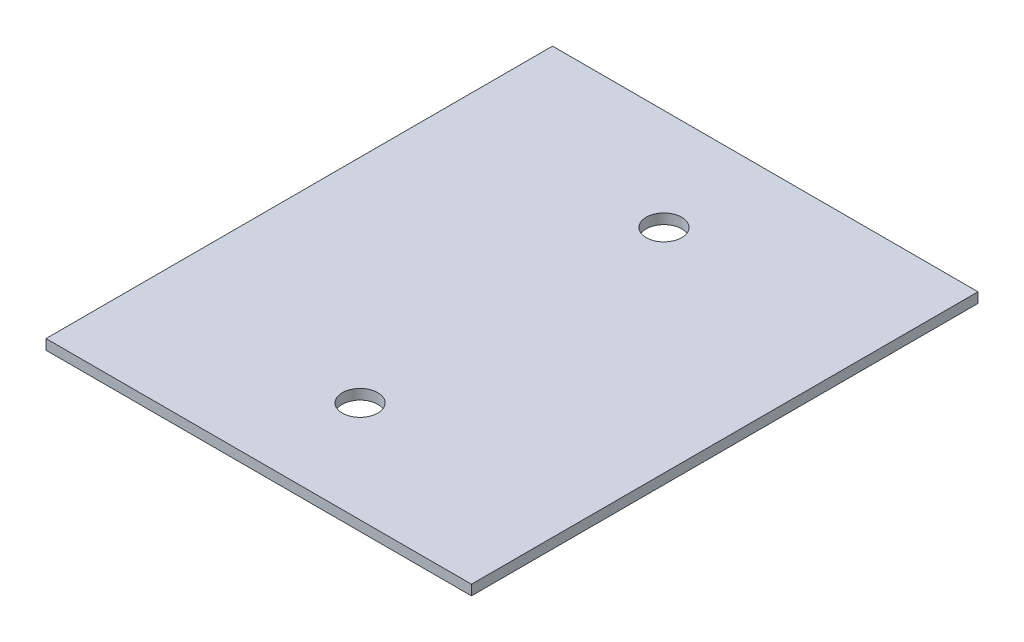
ISO-10303-21;
HEADER;
FILE_DESCRIPTION(('STEP AP214'),'2;1');
FILE_NAME('part.step','',(''),(''),'','','');
FILE_SCHEMA(('AUTOMOTIVE_DESIGN { 1 0 10303 214 1 1 1 1 }'));
ENDSEC;
DATA;
#1=APPLICATION_CONTEXT('core data for automotive mechanical design processes');
#2=APPLICATION_PROTOCOL_DEFINITION('international standard','automotive_design',2000,#1);
#3=PRODUCT_CONTEXT('',#1,'mechanical');
#4=PRODUCT('Part','Part','',(#3));
#5=PRODUCT_RELATED_PRODUCT_CATEGORY('part','',(#4));
#6=PRODUCT_DEFINITION_FORMATION('','',#4);
#7=PRODUCT_DEFINITION_CONTEXT('part definition',#1,'design');
#8=PRODUCT_DEFINITION('design','',#6,#7);
#9=PRODUCT_DEFINITION_SHAPE('','',#8);
#10=(LENGTH_UNIT() NAMED_UNIT(*) SI_UNIT(.MILLI.,.METRE.));
#11=(NAMED_UNIT(*) PLANE_ANGLE_UNIT() SI_UNIT($,.RADIAN.));
#12=(NAMED_UNIT(*) SI_UNIT($,.STERADIAN.) SOLID_ANGLE_UNIT());
#13=UNCERTAINTY_MEASURE_WITH_UNIT(LENGTH_MEASURE(1.E-05),#10,'distance_accuracy_value','');
#14=(GEOMETRIC_REPRESENTATION_CONTEXT(3) GLOBAL_UNCERTAINTY_ASSIGNED_CONTEXT((#13)) GLOBAL_UNIT_ASSIGNED_CONTEXT((#10,
#11,#12)) REPRESENTATION_CONTEXT('',''));
#15=CARTESIAN_POINT('',(0.,0.,0.));
#16=DIRECTION('',(0.,0.,1.));
#17=DIRECTION('',(1.,0.,0.));
#18=AXIS2_PLACEMENT_3D('',#15,#16,#17);
#19=CARTESIAN_POINT('',(0.,1.,0.));
#20=DIRECTION('',(0.,-1.,0.));
#21=DIRECTION('',(0.,0.,-1.));
#22=AXIS2_PLACEMENT_3D('',#19,#20,#21);
#23=PLANE('',#22);
#24=DIRECTION('',(0.,0.,1.));
#25=VECTOR('',#24,1.);
#26=CARTESIAN_POINT('',(0.,1.,0.));
#27=LINE('',#26,#25);
#28=CARTESIAN_POINT('',(0.,1.,-50.));
#29=VERTEX_POINT('',#28);
#30=CARTESIAN_POINT('',(0.,1.,0.));
#31=VERTEX_POINT('',#30);
#32=EDGE_CURVE('E85',#29,#31,#27,.T.);
#33=ORIENTED_EDGE('',*,*,#32,.T.);
#34=DIRECTION('',(1.,0.,0.));
#35=VECTOR('',#34,1.);
#36=CARTESIAN_POINT('',(0.,1.,0.));
#37=LINE('',#36,#35);
#38=CARTESIAN_POINT('',(42.,1.,0.));
#39=VERTEX_POINT('',#38);
#40=EDGE_CURVE('E80',#31,#39,#37,.T.);
#41=ORIENTED_EDGE('',*,*,#40,.T.);
#42=DIRECTION('',(0.,0.,-1.));
#43=VECTOR('',#42,1.);
#44=CARTESIAN_POINT('',(42.,1.,0.));
#45=LINE('',#44,#43);
#46=CARTESIAN_POINT('',(42.,1.,-50.));
#47=VERTEX_POINT('',#46);
#48=EDGE_CURVE('E83',#39,#47,#45,.T.);
#49=ORIENTED_EDGE('',*,*,#48,.T.);
#50=DIRECTION('',(-1.,0.,0.));
#51=VECTOR('',#50,1.);
#52=CARTESIAN_POINT('',(0.,1.,-50.));
#53=LINE('',#52,#51);
#54=EDGE_CURVE('E50',#47,#29,#53,.T.);
#55=ORIENTED_EDGE('',*,*,#54,.T.);
#56=EDGE_LOOP('',(#33,#41,#49,#55));
#57=FACE_BOUND('',#56,.T.);
#58=CARTESIAN_POINT('',(21.,1.,-40.));
#59=DIRECTION('',(0.,1.,0.));
#60=DIRECTION('',(0.,0.,1.));
#61=AXIS2_PLACEMENT_3D('',#58,#59,#60);
#62=CIRCLE('',#61,1.75);
#63=CARTESIAN_POINT('',(21.,1.,-38.25));
#64=VERTEX_POINT('',#63);
#65=EDGE_CURVE('E100',#64,#64,#62,.T.);
#66=ORIENTED_EDGE('',*,*,#65,.F.);
#67=EDGE_LOOP('',(#66));
#68=FACE_BOUND('',#67,.T.);
#69=CARTESIAN_POINT('',(21.,1.,-10.));
#70=DIRECTION('',(0.,1.,0.));
#71=DIRECTION('',(0.,0.,1.));
#72=AXIS2_PLACEMENT_3D('',#69,#70,#71);
#73=CIRCLE('',#72,1.75);
#74=CARTESIAN_POINT('',(21.,1.,-8.25));
#75=VERTEX_POINT('',#74);
#76=EDGE_CURVE('E115',#75,#75,#73,.T.);
#77=ORIENTED_EDGE('',*,*,#76,.F.);
#78=EDGE_LOOP('',(#77));
#79=FACE_BOUND('',#78,.T.);
#80=ADVANCED_FACE('F33',(#57,#68,#79),#23,.F.);
#81=CARTESIAN_POINT('',(0.,0.,0.));
#82=DIRECTION('',(0.,-1.,0.));
#83=DIRECTION('',(0.,0.,-1.));
#84=AXIS2_PLACEMENT_3D('',#81,#82,#83);
#85=PLANE('',#84);
#86=CARTESIAN_POINT('',(21.,0.,-40.));
#87=DIRECTION('',(0.,1.,0.));
#88=DIRECTION('',(0.,0.,1.));
#89=AXIS2_PLACEMENT_3D('',#86,#87,#88);
#90=CIRCLE('',#89,1.75);
#91=CARTESIAN_POINT('',(21.,0.,-38.25));
#92=VERTEX_POINT('',#91);
#93=EDGE_CURVE('E112',#92,#92,#90,.T.);
#94=ORIENTED_EDGE('',*,*,#93,.T.);
#95=EDGE_LOOP('',(#94));
#96=FACE_BOUND('',#95,.T.);
#97=DIRECTION('',(0.,0.,1.));
#98=VECTOR('',#97,1.);
#99=CARTESIAN_POINT('',(0.,0.,0.));
#100=LINE('',#99,#98);
#101=CARTESIAN_POINT('',(0.,0.,-50.));
#102=VERTEX_POINT('',#101);
#103=CARTESIAN_POINT('',(0.,0.,0.));
#104=VERTEX_POINT('',#103);
#105=EDGE_CURVE('E97',#102,#104,#100,.T.);
#106=ORIENTED_EDGE('',*,*,#105,.F.);
#107=DIRECTION('',(-1.,0.,0.));
#108=VECTOR('',#107,1.);
#109=CARTESIAN_POINT('',(0.,0.,-50.));
#110=LINE('',#109,#108);
#111=CARTESIAN_POINT('',(42.,0.,-50.));
#112=VERTEX_POINT('',#111);
#113=EDGE_CURVE('E73',#112,#102,#110,.T.);
#114=ORIENTED_EDGE('',*,*,#113,.F.);
#115=DIRECTION('',(0.,0.,-1.));
#116=VECTOR('',#115,1.);
#117=CARTESIAN_POINT('',(42.,0.,0.));
#118=LINE('',#117,#116);
#119=CARTESIAN_POINT('',(42.,0.,0.));
#120=VERTEX_POINT('',#119);
#121=EDGE_CURVE('E67',#120,#112,#118,.T.);
#122=ORIENTED_EDGE('',*,*,#121,.F.);
#123=DIRECTION('',(1.,0.,0.));
#124=VECTOR('',#123,1.);
#125=CARTESIAN_POINT('',(0.,0.,0.));
#126=LINE('',#125,#124);
#127=EDGE_CURVE('E89',#104,#120,#126,.T.);
#128=ORIENTED_EDGE('',*,*,#127,.F.);
#129=EDGE_LOOP('',(#106,#114,#122,#128));
#130=FACE_BOUND('',#129,.T.);
#131=CARTESIAN_POINT('',(21.,0.,-10.));
#132=DIRECTION('',(0.,1.,0.));
#133=DIRECTION('',(0.,0.,1.));
#134=AXIS2_PLACEMENT_3D('',#131,#132,#133);
#135=CIRCLE('',#134,1.75);
#136=CARTESIAN_POINT('',(21.,0.,-8.25));
#137=VERTEX_POINT('',#136);
#138=EDGE_CURVE('E118',#137,#137,#135,.T.);
#139=ORIENTED_EDGE('',*,*,#138,.T.);
#140=EDGE_LOOP('',(#139));
#141=FACE_BOUND('',#140,.T.);
#142=ADVANCED_FACE('F108',(#96,#130,#141),#85,.T.);
#143=CARTESIAN_POINT('',(0.,1.,0.));
#144=DIRECTION('',(1.,0.,0.));
#145=DIRECTION('',(0.,0.,-1.));
#146=AXIS2_PLACEMENT_3D('',#143,#144,#145);
#147=PLANE('',#146);
#148=ORIENTED_EDGE('',*,*,#105,.T.);
#149=DIRECTION('',(0.,-1.,0.));
#150=VECTOR('',#149,1.);
#151=CARTESIAN_POINT('',(0.,1.,0.));
#152=LINE('',#151,#150);
#153=EDGE_CURVE('E11',#31,#104,#152,.T.);
#154=ORIENTED_EDGE('',*,*,#153,.F.);
#155=ORIENTED_EDGE('',*,*,#32,.F.);
#156=DIRECTION('',(0.,-1.,0.));
#157=VECTOR('',#156,1.);
#158=CARTESIAN_POINT('',(0.,1.,-50.));
#159=LINE('',#158,#157);
#160=EDGE_CURVE('E93',#29,#102,#159,.T.);
#161=ORIENTED_EDGE('',*,*,#160,.T.);
#162=EDGE_LOOP('',(#148,#154,#155,#161));
#163=FACE_BOUND('',#162,.T.);
#164=ADVANCED_FACE('F35',(#163),#147,.F.);
#165=CARTESIAN_POINT('',(0.,1.,0.));
#166=DIRECTION('',(0.,0.,-1.));
#167=DIRECTION('',(-1.,0.,0.));
#168=AXIS2_PLACEMENT_3D('',#165,#166,#167);
#169=PLANE('',#168);
#170=ORIENTED_EDGE('',*,*,#127,.T.);
#171=DIRECTION('',(0.,-1.,0.));
#172=VECTOR('',#171,1.);
#173=CARTESIAN_POINT('',(42.,1.,0.));
#174=LINE('',#173,#172);
#175=EDGE_CURVE('E42',#39,#120,#174,.T.);
#176=ORIENTED_EDGE('',*,*,#175,.F.);
#177=ORIENTED_EDGE('',*,*,#40,.F.);
#178=ORIENTED_EDGE('',*,*,#153,.T.);
#179=EDGE_LOOP('',(#170,#176,#177,#178));
#180=FACE_BOUND('',#179,.T.);
#181=ADVANCED_FACE('F88',(#180),#169,.F.);
#182=CARTESIAN_POINT('',(42.,1.,0.));
#183=DIRECTION('',(-1.,0.,0.));
#184=DIRECTION('',(0.,0.,1.));
#185=AXIS2_PLACEMENT_3D('',#182,#183,#184);
#186=PLANE('',#185);
#187=ORIENTED_EDGE('',*,*,#121,.T.);
#188=DIRECTION('',(0.,-1.,0.));
#189=VECTOR('',#188,1.);
#190=CARTESIAN_POINT('',(42.,1.,-50.));
#191=LINE('',#190,#189);
#192=EDGE_CURVE('E90',#47,#112,#191,.T.);
#193=ORIENTED_EDGE('',*,*,#192,.F.);
#194=ORIENTED_EDGE('',*,*,#48,.F.);
#195=ORIENTED_EDGE('',*,*,#175,.T.);
#196=EDGE_LOOP('',(#187,#193,#194,#195));
#197=FACE_BOUND('',#196,.T.);
#198=ADVANCED_FACE('F91',(#197),#186,.F.);
#199=CARTESIAN_POINT('',(0.,1.,-50.));
#200=DIRECTION('',(0.,0.,1.));
#201=DIRECTION('',(1.,0.,0.));
#202=AXIS2_PLACEMENT_3D('',#199,#200,#201);
#203=PLANE('',#202);
#204=ORIENTED_EDGE('',*,*,#113,.T.);
#205=ORIENTED_EDGE('',*,*,#160,.F.);
#206=ORIENTED_EDGE('',*,*,#54,.F.);
#207=ORIENTED_EDGE('',*,*,#192,.T.);
#208=EDGE_LOOP('',(#204,#205,#206,#207));
#209=FACE_BOUND('',#208,.T.);
#210=ADVANCED_FACE('F105',(#209),#203,.F.);
#211=CARTESIAN_POINT('',(21.,1.,-40.));
#212=DIRECTION('',(0.,-1.,0.));
#213=DIRECTION('',(0.,0.,-1.));
#214=AXIS2_PLACEMENT_3D('',#211,#212,#213);
#215=CYLINDRICAL_SURFACE('',#214,1.75);
#216=ORIENTED_EDGE('',*,*,#65,.T.);
#217=EDGE_LOOP('',(#216));
#218=FACE_BOUND('',#217,.T.);
#219=ORIENTED_EDGE('',*,*,#93,.F.);
#220=EDGE_LOOP('',(#219));
#221=FACE_BOUND('',#220,.T.);
#222=ADVANCED_FACE('F135',(#218,#221),#215,.F.);
#223=CARTESIAN_POINT('',(21.,1.,-10.));
#224=DIRECTION('',(0.,-1.,0.));
#225=DIRECTION('',(0.,0.,-1.));
#226=AXIS2_PLACEMENT_3D('',#223,#224,#225);
#227=CYLINDRICAL_SURFACE('',#226,1.75);
#228=ORIENTED_EDGE('',*,*,#76,.T.);
#229=EDGE_LOOP('',(#228));
#230=FACE_BOUND('',#229,.T.);
#231=ORIENTED_EDGE('',*,*,#138,.F.);
#232=EDGE_LOOP('',(#231));
#233=FACE_BOUND('',#232,.T.);
#234=ADVANCED_FACE('F124',(#230,#233),#227,.F.);
#235=CLOSED_SHELL('',(#80,#142,#164,#181,#198,#210,#222,#234));
#236=MANIFOLD_SOLID_BREP('B2',#235);
#237=ADVANCED_BREP_SHAPE_REPRESENTATION('',(#18,#236),#14);
#238=SHAPE_DEFINITION_REPRESENTATION(#9,#237);
ENDSEC;
END-ISO-10303-21;
